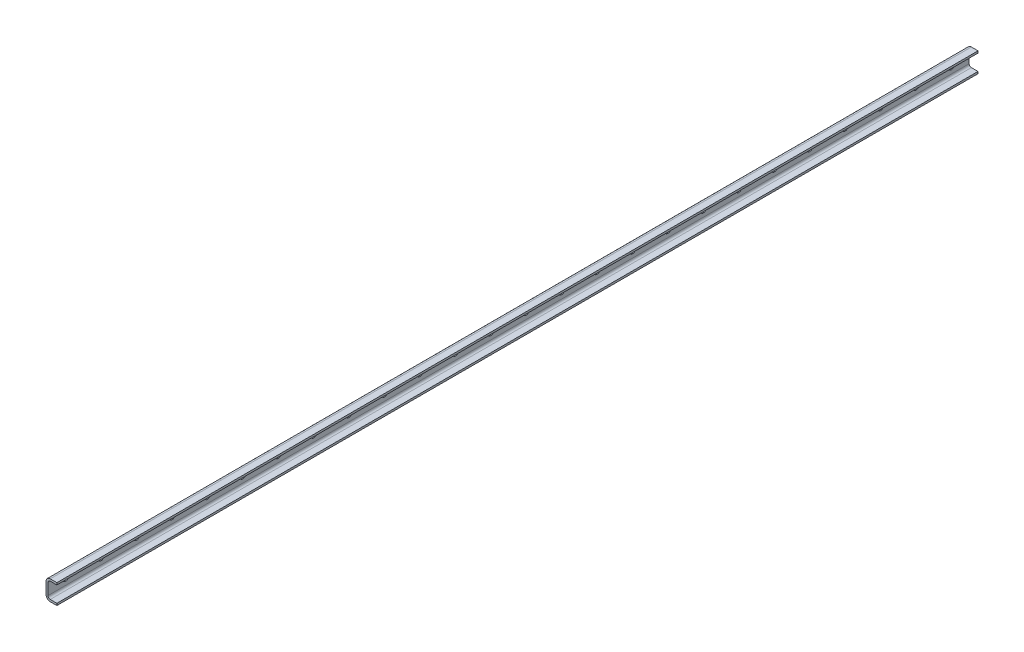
from build123d import *

# Parameters (mm, degrees)
EXTRUDE1_DEPTH  = 2080
EXTRUDE2_DEPTH  = 2081.216757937
LPATTERN1_COUNT = 26
LPATTERN1_PITCH = 80


with BuildPart() as part:
    # Sketch1 → Extrude1 (new body)
    with BuildSketch(Plane.XY):
        with BuildLine():
            Line((24.5, 17.9), (24.5, 22.4))
            Line((24.5, 22.4), (9.5, 22.4))
            ThreePointArc((9.5, 22.4), (2.782485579, 19.617514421), (0, 12.9))
            Line((0, 12.9), (0, -12.9))
            ThreePointArc((0, -12.9), (2.782485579, -19.617514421), (9.5, -22.4))
            Line((9.5, -22.4), (24.5, -22.4))
            Line((24.5, -22.4), (24.5, -17.9))
            Line((24.5, -17.9), (9.5, -17.9))
            ThreePointArc((9.5, -17.9), (5.964466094, -16.435533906), (4.5, -12.9))
            Line((4.5, -12.9), (4.5, 12.9))
            ThreePointArc((4.5, 12.9), (5.964466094, 16.435533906), (9.5, 17.9))
            Line((9.5, 17.9), (24.5, 17.9))
        make_face()
    extrude(amount=-EXTRUDE1_DEPTH)

    # Sketch2 → Extrude2 (cut, through all)
    with BuildSketch(Plane(origin=(4.5, 0, 0), x_dir=(0, 0, -1), z_dir=(1, 0, 0))):
        with BuildLine():
            Line((39, 4.5), (41, 4.5))
            ThreePointArc((41, 4.5), (45.5, 0), (41, -4.5))
            Line((41, -4.5), (39, -4.5))
            ThreePointArc((39, -4.5), (34.5, 0), (39, 4.5))
        make_face()
    extrude2 = extrude(amount=-EXTRUDE2_DEPTH, mode=Mode.SUBTRACT)

    # LPattern1: Extrude2 ×26
    with Locations(*[(0, 0, -i * LPATTERN1_PITCH) for i in range(1, LPATTERN1_COUNT)]):
        add(extrude2, mode=Mode.SUBTRACT)


solid = part.part
